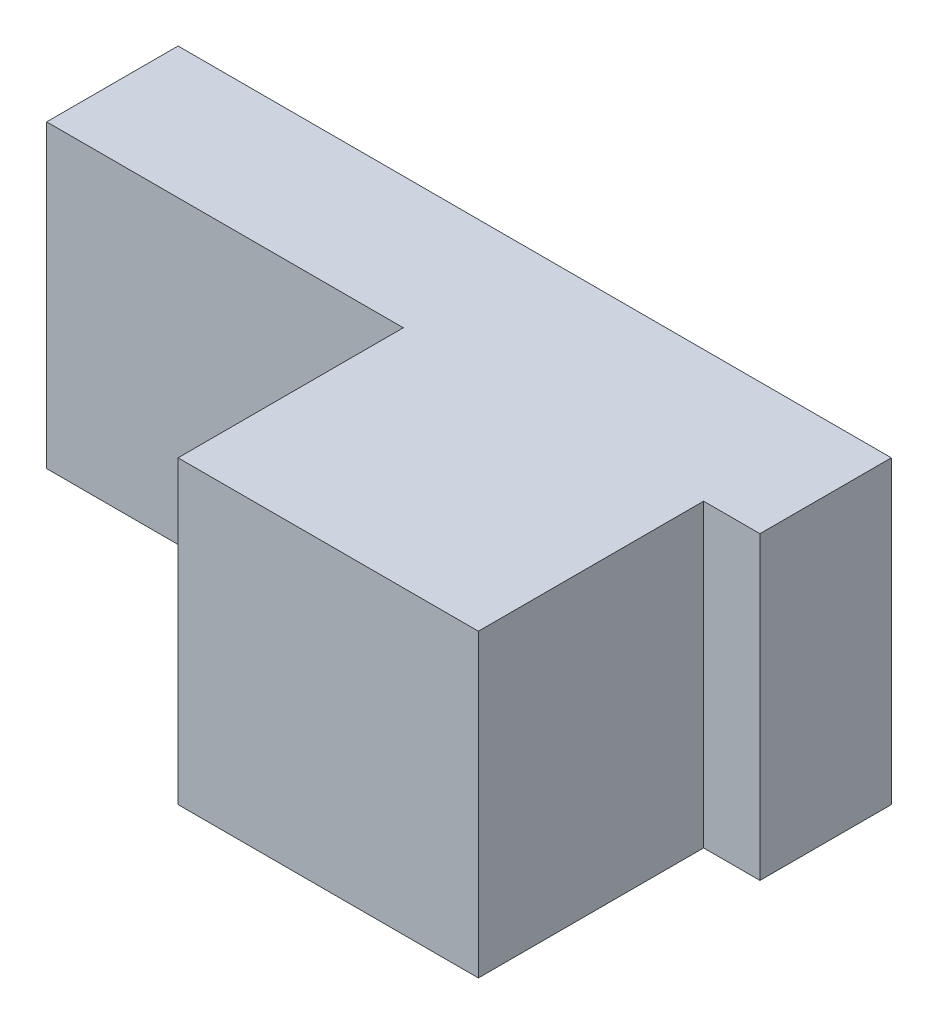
ISO-10303-21;
HEADER;
FILE_DESCRIPTION(('STEP AP214'),'2;1');
FILE_NAME('part.step','',(''),(''),'','','');
FILE_SCHEMA(('AUTOMOTIVE_DESIGN { 1 0 10303 214 1 1 1 1 }'));
ENDSEC;
DATA;
#1=APPLICATION_CONTEXT('core data for automotive mechanical design processes');
#2=APPLICATION_PROTOCOL_DEFINITION('international standard','automotive_design',2000,#1);
#3=PRODUCT_CONTEXT('',#1,'mechanical');
#4=PRODUCT('Part','Part','',(#3));
#5=PRODUCT_RELATED_PRODUCT_CATEGORY('part','',(#4));
#6=PRODUCT_DEFINITION_FORMATION('','',#4);
#7=PRODUCT_DEFINITION_CONTEXT('part definition',#1,'design');
#8=PRODUCT_DEFINITION('design','',#6,#7);
#9=PRODUCT_DEFINITION_SHAPE('','',#8);
#10=(LENGTH_UNIT() NAMED_UNIT(*) SI_UNIT(.MILLI.,.METRE.));
#11=(NAMED_UNIT(*) PLANE_ANGLE_UNIT() SI_UNIT($,.RADIAN.));
#12=(NAMED_UNIT(*) SI_UNIT($,.STERADIAN.) SOLID_ANGLE_UNIT());
#13=UNCERTAINTY_MEASURE_WITH_UNIT(LENGTH_MEASURE(1.E-05),#10,'distance_accuracy_value','');
#14=(GEOMETRIC_REPRESENTATION_CONTEXT(3) GLOBAL_UNCERTAINTY_ASSIGNED_CONTEXT((#13)) GLOBAL_UNIT_ASSIGNED_CONTEXT((#10,
#11,#12)) REPRESENTATION_CONTEXT('',''));
#15=CARTESIAN_POINT('',(0.,0.,0.));
#16=DIRECTION('',(0.,0.,1.));
#17=DIRECTION('',(1.,0.,0.));
#18=AXIS2_PLACEMENT_3D('',#15,#16,#17);
#19=CARTESIAN_POINT('',(-9.5,-4.,3.5));
#20=DIRECTION('',(0.,0.,1.));
#21=DIRECTION('',(1.,0.,0.));
#22=AXIS2_PLACEMENT_3D('',#19,#20,#21);
#23=PLANE('',#22);
#24=DIRECTION('',(0.,-1.,0.));
#25=VECTOR('',#24,1.);
#26=CARTESIAN_POINT('',(0.,4.,3.5));
#27=LINE('',#26,#25);
#28=CARTESIAN_POINT('',(0.,4.,3.5));
#29=VERTEX_POINT('',#28);
#30=CARTESIAN_POINT('',(0.,-4.,3.5));
#31=VERTEX_POINT('',#30);
#32=EDGE_CURVE('E50',#29,#31,#27,.T.);
#33=ORIENTED_EDGE('',*,*,#32,.F.);
#34=DIRECTION('',(-1.,0.,0.));
#35=VECTOR('',#34,1.);
#36=CARTESIAN_POINT('',(-9.5,4.,3.5));
#37=LINE('',#36,#35);
#38=CARTESIAN_POINT('',(-9.5,4.,3.5));
#39=VERTEX_POINT('',#38);
#40=EDGE_CURVE('E107',#29,#39,#37,.T.);
#41=ORIENTED_EDGE('',*,*,#40,.T.);
#42=DIRECTION('',(0.,-1.,0.));
#43=VECTOR('',#42,1.);
#44=CARTESIAN_POINT('',(-9.5,4.,3.5));
#45=LINE('',#44,#43);
#46=CARTESIAN_POINT('',(-9.5,-4.,3.5));
#47=VERTEX_POINT('',#46);
#48=EDGE_CURVE('E159',#39,#47,#45,.T.);
#49=ORIENTED_EDGE('',*,*,#48,.T.);
#50=DIRECTION('',(1.,0.,0.));
#51=VECTOR('',#50,1.);
#52=CARTESIAN_POINT('',(-9.5,-4.,3.5));
#53=LINE('',#52,#51);
#54=EDGE_CURVE('E169',#47,#31,#53,.T.);
#55=ORIENTED_EDGE('',*,*,#54,.T.);
#56=EDGE_LOOP('',(#33,#41,#49,#55));
#57=FACE_BOUND('',#56,.T.);
#58=ADVANCED_FACE('F33',(#57),#23,.T.);
#59=CARTESIAN_POINT('',(-9.5,4.,3.5));
#60=DIRECTION('',(1.,0.,0.));
#61=DIRECTION('',(0.,1.,0.));
#62=AXIS2_PLACEMENT_3D('',#59,#60,#61);
#63=PLANE('',#62);
#64=DIRECTION('',(0.,-1.,0.));
#65=VECTOR('',#64,1.);
#66=CARTESIAN_POINT('',(-9.5,4.,0.));
#67=LINE('',#66,#65);
#68=CARTESIAN_POINT('',(-9.5,4.,0.));
#69=VERTEX_POINT('',#68);
#70=CARTESIAN_POINT('',(-9.5,-4.,0.));
#71=VERTEX_POINT('',#70);
#72=EDGE_CURVE('E137',#69,#71,#67,.T.);
#73=ORIENTED_EDGE('',*,*,#72,.T.);
#74=DIRECTION('',(0.,0.,-1.));
#75=VECTOR('',#74,1.);
#76=CARTESIAN_POINT('',(-9.5,-4.,3.5));
#77=LINE('',#76,#75);
#78=EDGE_CURVE('E11',#47,#71,#77,.T.);
#79=ORIENTED_EDGE('',*,*,#78,.F.);
#80=ORIENTED_EDGE('',*,*,#48,.F.);
#81=DIRECTION('',(0.,0.,-1.));
#82=VECTOR('',#81,1.);
#83=CARTESIAN_POINT('',(-9.5,4.,3.5));
#84=LINE('',#83,#82);
#85=EDGE_CURVE('E106',#39,#69,#84,.T.);
#86=ORIENTED_EDGE('',*,*,#85,.T.);
#87=EDGE_LOOP('',(#73,#79,#80,#86));
#88=FACE_BOUND('',#87,.T.);
#89=ADVANCED_FACE('F35',(#88),#63,.F.);
#90=CARTESIAN_POINT('',(-9.5,-4.,3.5));
#91=DIRECTION('',(0.,1.,0.));
#92=DIRECTION('',(-1.,0.,0.));
#93=AXIS2_PLACEMENT_3D('',#90,#91,#92);
#94=PLANE('',#93);
#95=DIRECTION('',(1.,0.,0.));
#96=VECTOR('',#95,1.);
#97=CARTESIAN_POINT('',(-9.5,-4.,0.));
#98=LINE('',#97,#96);
#99=CARTESIAN_POINT('',(9.5,-4.,0.));
#100=VERTEX_POINT('',#99);
#101=EDGE_CURVE('E153',#71,#100,#98,.T.);
#102=ORIENTED_EDGE('',*,*,#101,.T.);
#103=DIRECTION('',(0.,0.,-1.));
#104=VECTOR('',#103,1.);
#105=CARTESIAN_POINT('',(9.5,-4.,3.5));
#106=LINE('',#105,#104);
#107=CARTESIAN_POINT('',(9.5,-4.,3.5));
#108=VERTEX_POINT('',#107);
#109=EDGE_CURVE('E42',#108,#100,#106,.T.);
#110=ORIENTED_EDGE('',*,*,#109,.F.);
#111=CARTESIAN_POINT('',(8.,-4.,3.5));
#112=VERTEX_POINT('',#111);
#113=EDGE_CURVE('E162',#112,#108,#53,.T.);
#114=ORIENTED_EDGE('',*,*,#113,.F.);
#115=DIRECTION('',(0.,0.,-1.));
#116=VECTOR('',#115,1.);
#117=CARTESIAN_POINT('',(8.,-4.,9.5));
#118=LINE('',#117,#116);
#119=CARTESIAN_POINT('',(8.,-4.,9.5));
#120=VERTEX_POINT('',#119);
#121=EDGE_CURVE('E117',#120,#112,#118,.T.);
#122=ORIENTED_EDGE('',*,*,#121,.F.);
#123=DIRECTION('',(1.,0.,0.));
#124=VECTOR('',#123,1.);
#125=CARTESIAN_POINT('',(0.,-4.,9.5));
#126=LINE('',#125,#124);
#127=CARTESIAN_POINT('',(0.,-4.,9.5));
#128=VERTEX_POINT('',#127);
#129=EDGE_CURVE('E146',#128,#120,#126,.T.);
#130=ORIENTED_EDGE('',*,*,#129,.F.);
#131=DIRECTION('',(0.,0.,-1.));
#132=VECTOR('',#131,1.);
#133=CARTESIAN_POINT('',(0.,-4.,9.5));
#134=LINE('',#133,#132);
#135=EDGE_CURVE('E125',#128,#31,#134,.T.);
#136=ORIENTED_EDGE('',*,*,#135,.T.);
#137=ORIENTED_EDGE('',*,*,#54,.F.);
#138=ORIENTED_EDGE('',*,*,#78,.T.);
#139=EDGE_LOOP('',(#102,#110,#114,#122,#130,#136,#137,#138));
#140=FACE_BOUND('',#139,.T.);
#141=ADVANCED_FACE('F185',(#140),#94,.F.);
#142=CARTESIAN_POINT('',(9.5,4.,3.5));
#143=DIRECTION('',(-1.,0.,0.));
#144=DIRECTION('',(0.,0.,1.));
#145=AXIS2_PLACEMENT_3D('',#142,#143,#144);
#146=PLANE('',#145);
#147=DIRECTION('',(0.,1.,0.));
#148=VECTOR('',#147,1.);
#149=CARTESIAN_POINT('',(9.5,4.,0.));
#150=LINE('',#149,#148);
#151=CARTESIAN_POINT('',(9.5,4.,0.));
#152=VERTEX_POINT('',#151);
#153=EDGE_CURVE('E155',#100,#152,#150,.T.);
#154=ORIENTED_EDGE('',*,*,#153,.T.);
#155=DIRECTION('',(0.,0.,-1.));
#156=VECTOR('',#155,1.);
#157=CARTESIAN_POINT('',(9.5,4.,3.5));
#158=LINE('',#157,#156);
#159=CARTESIAN_POINT('',(9.5,4.,3.5));
#160=VERTEX_POINT('',#159);
#161=EDGE_CURVE('E173',#160,#152,#158,.T.);
#162=ORIENTED_EDGE('',*,*,#161,.F.);
#163=DIRECTION('',(0.,1.,0.));
#164=VECTOR('',#163,1.);
#165=CARTESIAN_POINT('',(9.5,4.,3.5));
#166=LINE('',#165,#164);
#167=EDGE_CURVE('E101',#108,#160,#166,.T.);
#168=ORIENTED_EDGE('',*,*,#167,.F.);
#169=ORIENTED_EDGE('',*,*,#109,.T.);
#170=EDGE_LOOP('',(#154,#162,#168,#169));
#171=FACE_BOUND('',#170,.T.);
#172=ADVANCED_FACE('F195',(#171),#146,.F.);
#173=CARTESIAN_POINT('',(-9.5,4.,3.5));
#174=DIRECTION('',(0.,-1.,0.));
#175=DIRECTION('',(0.,0.,-1.));
#176=AXIS2_PLACEMENT_3D('',#173,#174,#175);
#177=PLANE('',#176);
#178=DIRECTION('',(-1.,0.,0.));
#179=VECTOR('',#178,1.);
#180=CARTESIAN_POINT('',(-9.5,4.,0.));
#181=LINE('',#180,#179);
#182=EDGE_CURVE('E157',#152,#69,#181,.T.);
#183=ORIENTED_EDGE('',*,*,#182,.T.);
#184=ORIENTED_EDGE('',*,*,#85,.F.);
#185=ORIENTED_EDGE('',*,*,#40,.F.);
#186=DIRECTION('',(0.,0.,-1.));
#187=VECTOR('',#186,1.);
#188=CARTESIAN_POINT('',(0.,4.,9.5));
#189=LINE('',#188,#187);
#190=CARTESIAN_POINT('',(0.,4.,9.5));
#191=VERTEX_POINT('',#190);
#192=EDGE_CURVE('E123',#191,#29,#189,.T.);
#193=ORIENTED_EDGE('',*,*,#192,.F.);
#194=DIRECTION('',(-1.,0.,0.));
#195=VECTOR('',#194,1.);
#196=CARTESIAN_POINT('',(0.,4.,9.5));
#197=LINE('',#196,#195);
#198=CARTESIAN_POINT('',(8.,4.,9.5));
#199=VERTEX_POINT('',#198);
#200=EDGE_CURVE('E122',#199,#191,#197,.T.);
#201=ORIENTED_EDGE('',*,*,#200,.F.);
#202=DIRECTION('',(0.,0.,-1.));
#203=VECTOR('',#202,1.);
#204=CARTESIAN_POINT('',(8.,4.,9.5));
#205=LINE('',#204,#203);
#206=CARTESIAN_POINT('',(8.,4.,3.5));
#207=VERTEX_POINT('',#206);
#208=EDGE_CURVE('E114',#199,#207,#205,.T.);
#209=ORIENTED_EDGE('',*,*,#208,.T.);
#210=EDGE_CURVE('E98',#160,#207,#37,.T.);
#211=ORIENTED_EDGE('',*,*,#210,.F.);
#212=ORIENTED_EDGE('',*,*,#161,.T.);
#213=EDGE_LOOP('',(#183,#184,#185,#193,#201,#209,#211,#212));
#214=FACE_BOUND('',#213,.T.);
#215=ADVANCED_FACE('F120',(#214),#177,.F.);
#216=DIRECTION('',(0.,1.,0.));
#217=VECTOR('',#216,1.);
#218=CARTESIAN_POINT('',(8.,4.,3.5));
#219=LINE('',#218,#217);
#220=EDGE_CURVE('E58',#112,#207,#219,.T.);
#221=ORIENTED_EDGE('',*,*,#220,.F.);
#222=ORIENTED_EDGE('',*,*,#113,.T.);
#223=ORIENTED_EDGE('',*,*,#167,.T.);
#224=ORIENTED_EDGE('',*,*,#210,.T.);
#225=EDGE_LOOP('',(#221,#222,#223,#224));
#226=FACE_BOUND('',#225,.T.);
#227=ADVANCED_FACE('F99',(#226),#23,.T.);
#228=CARTESIAN_POINT('',(-9.5,-4.,0.));
#229=DIRECTION('',(0.,0.,1.));
#230=DIRECTION('',(1.,0.,0.));
#231=AXIS2_PLACEMENT_3D('',#228,#229,#230);
#232=PLANE('',#231);
#233=ORIENTED_EDGE('',*,*,#72,.F.);
#234=ORIENTED_EDGE('',*,*,#182,.F.);
#235=ORIENTED_EDGE('',*,*,#153,.F.);
#236=ORIENTED_EDGE('',*,*,#101,.F.);
#237=EDGE_LOOP('',(#233,#234,#235,#236));
#238=FACE_BOUND('',#237,.T.);
#239=ADVANCED_FACE('F197',(#238),#232,.F.);
#240=CARTESIAN_POINT('',(0.,4.,9.5));
#241=DIRECTION('',(1.,0.,0.));
#242=DIRECTION('',(0.,1.,0.));
#243=AXIS2_PLACEMENT_3D('',#240,#241,#242);
#244=PLANE('',#243);
#245=ORIENTED_EDGE('',*,*,#32,.T.);
#246=ORIENTED_EDGE('',*,*,#135,.F.);
#247=DIRECTION('',(0.,-1.,0.));
#248=VECTOR('',#247,1.);
#249=CARTESIAN_POINT('',(0.,4.,9.5));
#250=LINE('',#249,#248);
#251=EDGE_CURVE('E118',#191,#128,#250,.T.);
#252=ORIENTED_EDGE('',*,*,#251,.F.);
#253=ORIENTED_EDGE('',*,*,#192,.T.);
#254=EDGE_LOOP('',(#245,#246,#252,#253));
#255=FACE_BOUND('',#254,.T.);
#256=ADVANCED_FACE('F190',(#255),#244,.F.);
#257=CARTESIAN_POINT('',(8.,4.,9.5));
#258=DIRECTION('',(-1.,0.,0.));
#259=DIRECTION('',(0.,0.,1.));
#260=AXIS2_PLACEMENT_3D('',#257,#258,#259);
#261=PLANE('',#260);
#262=ORIENTED_EDGE('',*,*,#220,.T.);
#263=ORIENTED_EDGE('',*,*,#208,.F.);
#264=DIRECTION('',(0.,1.,0.));
#265=VECTOR('',#264,1.);
#266=CARTESIAN_POINT('',(8.,4.,9.5));
#267=LINE('',#266,#265);
#268=EDGE_CURVE('E148',#120,#199,#267,.T.);
#269=ORIENTED_EDGE('',*,*,#268,.F.);
#270=ORIENTED_EDGE('',*,*,#121,.T.);
#271=EDGE_LOOP('',(#262,#263,#269,#270));
#272=FACE_BOUND('',#271,.T.);
#273=ADVANCED_FACE('F112',(#272),#261,.F.);
#274=CARTESIAN_POINT('',(0.,-4.,9.5));
#275=DIRECTION('',(0.,0.,1.));
#276=DIRECTION('',(1.,0.,0.));
#277=AXIS2_PLACEMENT_3D('',#274,#275,#276);
#278=PLANE('',#277);
#279=ORIENTED_EDGE('',*,*,#251,.T.);
#280=ORIENTED_EDGE('',*,*,#129,.T.);
#281=ORIENTED_EDGE('',*,*,#268,.T.);
#282=ORIENTED_EDGE('',*,*,#200,.T.);
#283=EDGE_LOOP('',(#279,#280,#281,#282));
#284=FACE_BOUND('',#283,.T.);
#285=ADVANCED_FACE('F192',(#284),#278,.T.);
#286=CLOSED_SHELL('',(#58,#89,#141,#172,#215,#227,#239,#256,#273,#285));
#287=MANIFOLD_SOLID_BREP('B2',#286);
#288=ADVANCED_BREP_SHAPE_REPRESENTATION('',(#18,#287),#14);
#289=SHAPE_DEFINITION_REPRESENTATION(#9,#288);
ENDSEC;
END-ISO-10303-21;
